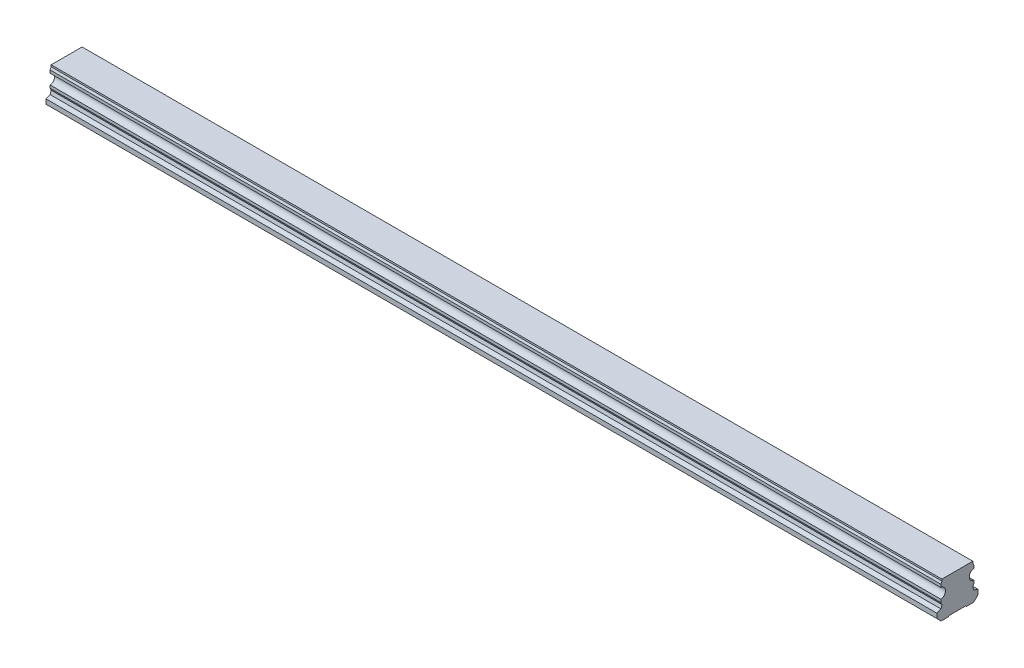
from build123d import *

# Parameters (mm, degrees)
BOSS_EXTRUDE1_DEPTH        = 540
SKETCH3_R                  = 3
SKETCH3_R_2                = 2.5
CUT_EXTRUDE3_DEPTH         = 12
SKETCH3_2_R                = 2.5
CUT_EXTRUDE4_DEPTH         = 15
CHAMFER1_SIZE              = 0.5
LPATTERN4_COUNT            = 9
LPATTERN4_PITCH            = 60
CHAMFER1_OF_LPATTERN4_SIZE = 0.5


with BuildPart() as part:
    # Sketch1 → Boss-Extrude1 (new body)
    with BuildSketch(Plane(origin=(0, 0, 0), x_dir=(0, 0, -1), z_dir=(1, 0, 0))):
        with BuildLine():
            Line((9.375, 21.8), (-9.375, 21.8))
            Line((-9.375, 21.8), (-9.375, 20.756))
            Line((-9.375, 20.756), (-10, 19.415683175))
            Line((-10, 19.415683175), (-10, 17.685449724))
            ThreePointArc((-10, 17.685449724), (-7.2, 14.6), (-10, 11.514550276))
            Line((-10, 11.514550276), (-10, 9.784316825))
            Line((-10, 9.784316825), (-9.375, 8.444))
            Line((-9.375, 8.444), (-9.922688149, 6.4))
            Line((-9.922688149, 6.4), (-12.5, 5.489338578))
            Line((-12.5, 5.489338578), (-12.5, 2.65))
            Line((-12.5, 2.65), (-9.85, 0))
            Line((-9.85, 0), (-5.5, 0))
            Line((-5.5, 0), (-5, 0.5))
            Line((-5, 0.5), (5, 0.5))
            Line((5, 0.5), (5.5, 0))
            Line((5.5, 0), (9.85, 0))
            Line((9.85, 0), (12.5, 2.65))
            Line((12.5, 2.65), (12.5, 5.489338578))
            Line((12.5, 5.489338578), (9.922688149, 6.4))
            Line((9.922688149, 6.4), (9.375, 8.444))
            Line((9.375, 8.444), (10, 9.784316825))
            Line((10, 9.784316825), (10, 11.514550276))
            ThreePointArc((10, 11.514550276), (7.2, 14.6), (10, 17.685449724))
            Line((10, 17.685449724), (10, 19.415683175))
            Line((10, 19.415683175), (9.375, 20.756))
            Line((9.375, 20.756), (9.375, 21.8))
        make_face()
    extrude(amount=BOSS_EXTRUDE1_DEPTH)

    # Sketch3 → Cut-Extrude3 (cut)
    with BuildSketch(Plane.XZ):
        with Locations(Location((30, 0, 0), (0, 0, 270))):
            Circle(SKETCH3_R)
        with Locations(Location((30, 0, 0), (0, 0, 270))):
            Circle(SKETCH3_R_2, mode=Mode.SUBTRACT)
    cut_extrude3 = extrude(amount=-CUT_EXTRUDE3_DEPTH, mode=Mode.SUBTRACT)

    # Sketch3_2 → Cut-Extrude4 (cut)
    with BuildSketch(Plane.XZ):
        with Locations(Location((30, 0, 0), (0, 0, 270))):
            Circle(SKETCH3_2_R)
    cut_extrude4 = extrude(amount=-CUT_EXTRUDE4_DEPTH, mode=Mode.SUBTRACT)

    # Cut-Extrude5 cone 1 section (on through the dimple's axis) → Cut-Extrude5 (revolve, cut)
    with BuildSketch(Plane(origin=(30, 15, 0), x_dir=(0, 0, -1), z_dir=(1, 0, 0))):
        Polygon((0, 0), (2.5, 0), (0, 1.443375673), align=None)
    cut_extrude5 = revolve(axis=Axis((30, 15, 0), (0, 1, 0)), mode=Mode.SUBTRACT)

    # Chamfer1
    chamfer1_edges = [part.edges().sort_by_distance(p)[0] for p in [
        (30, 0.5, 3),
    ]]
    chamfer(chamfer1_edges, length=CHAMFER1_SIZE)

    # LPattern4: Cut-Extrude3, Cut-Extrude4, Cut-Extrude5 ×9
    with Locations(*[(i * LPATTERN4_PITCH, 0, 0) for i in range(1, LPATTERN4_COUNT)]):
        add(cut_extrude3, mode=Mode.SUBTRACT)
        add(cut_extrude4, mode=Mode.SUBTRACT)
        add(cut_extrude5, mode=Mode.SUBTRACT)

    # Chamfer1 of LPattern4
    chamfer1_of_lpattern4_edges = [part.edges().sort_by_distance(p)[0] for p in [
        (90, 0.5, 3),
        (150, 0.5, 3),
        (210, 0.5, 3),
        (270, 0.5, 3),
        (330, 0.5, 3),
        (390, 0.5, 3),
        (450, 0.5, 3),
        (510, 0.5, 3),
    ]]
    chamfer(chamfer1_of_lpattern4_edges, length=CHAMFER1_OF_LPATTERN4_SIZE)


solid = part.part
